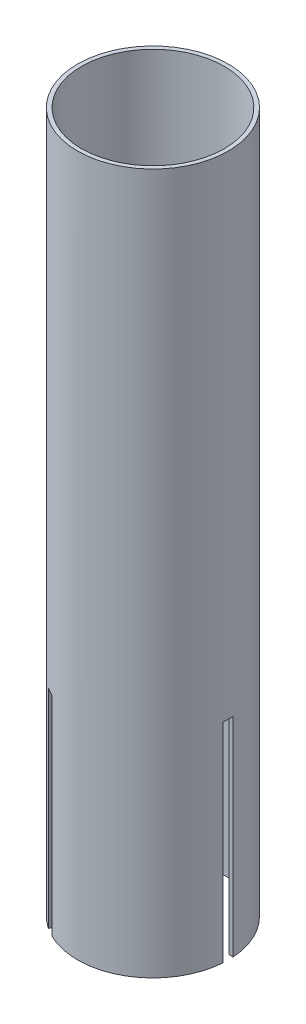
ISO-10303-21;
HEADER;
FILE_DESCRIPTION(('STEP AP214'),'2;1');
FILE_NAME('part.step','',(''),(''),'','','');
FILE_SCHEMA(('AUTOMOTIVE_DESIGN { 1 0 10303 214 1 1 1 1 }'));
ENDSEC;
DATA;
#1=APPLICATION_CONTEXT('core data for automotive mechanical design processes');
#2=APPLICATION_PROTOCOL_DEFINITION('international standard','automotive_design',2000,#1);
#3=PRODUCT_CONTEXT('',#1,'mechanical');
#4=PRODUCT('Part','Part','',(#3));
#5=PRODUCT_RELATED_PRODUCT_CATEGORY('part','',(#4));
#6=PRODUCT_DEFINITION_FORMATION('','',#4);
#7=PRODUCT_DEFINITION_CONTEXT('part definition',#1,'design');
#8=PRODUCT_DEFINITION('design','',#6,#7);
#9=PRODUCT_DEFINITION_SHAPE('','',#8);
#10=(LENGTH_UNIT() NAMED_UNIT(*) SI_UNIT(.MILLI.,.METRE.));
#11=(NAMED_UNIT(*) PLANE_ANGLE_UNIT() SI_UNIT($,.RADIAN.));
#12=(NAMED_UNIT(*) SI_UNIT($,.STERADIAN.) SOLID_ANGLE_UNIT());
#13=UNCERTAINTY_MEASURE_WITH_UNIT(LENGTH_MEASURE(1.E-05),#10,'distance_accuracy_value','');
#14=(GEOMETRIC_REPRESENTATION_CONTEXT(3) GLOBAL_UNCERTAINTY_ASSIGNED_CONTEXT((#13)) GLOBAL_UNIT_ASSIGNED_CONTEXT((#10,
#11,#12)) REPRESENTATION_CONTEXT('',''));
#15=CARTESIAN_POINT('',(0.,0.,0.));
#16=DIRECTION('',(0.,0.,1.));
#17=DIRECTION('',(1.,0.,0.));
#18=AXIS2_PLACEMENT_3D('',#15,#16,#17);
#19=CARTESIAN_POINT('',(0.,0.,0.));
#20=DIRECTION('',(0.,1.,0.));
#21=DIRECTION('',(0.,0.,1.));
#22=AXIS2_PLACEMENT_3D('',#19,#20,#21);
#23=PLANE('',#22);
#24=CARTESIAN_POINT('',(0.,0.,0.));
#25=DIRECTION('',(0.,1.,0.));
#26=DIRECTION('',(1.,0.,0.));
#27=AXIS2_PLACEMENT_3D('',#24,#25,#26);
#28=CIRCLE('',#27,27.178);
#29=CARTESIAN_POINT('',(-15.2053552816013,0.,-22.5264478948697));
#30=VERTEX_POINT('',#29);
#31=CARTESIAN_POINT('',(-15.2053552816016,0.,22.5264478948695));
#32=VERTEX_POINT('',#31);
#33=EDGE_CURVE('E141',#30,#32,#28,.T.);
#34=ORIENTED_EDGE('',*,*,#33,.T.);
#35=DIRECTION('',(0.500000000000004,0.,-0.866025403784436));
#36=VECTOR('',#35,1.);
#37=CARTESIAN_POINT('',(-17.4195842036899,0.,26.3616048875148));
#38=LINE('',#37,#36);
#39=CARTESIAN_POINT('',(-15.9691339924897,0.,23.8493514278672));
#40=VERTEX_POINT('',#39);
#41=EDGE_CURVE('E188',#40,#32,#38,.T.);
#42=ORIENTED_EDGE('',*,*,#41,.F.);
#43=CARTESIAN_POINT('',(0.,0.,0.));
#44=DIRECTION('',(0.,1.,0.));
#45=DIRECTION('',(0.,0.,1.));
#46=AXIS2_PLACEMENT_3D('',#43,#44,#45);
#47=CIRCLE('',#46,28.702);
#48=CARTESIAN_POINT('',(-15.9691339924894,0.,-23.8493514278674));
#49=VERTEX_POINT('',#48);
#50=EDGE_CURVE('E143',#49,#40,#47,.T.);
#51=ORIENTED_EDGE('',*,*,#50,.F.);
#52=DIRECTION('',(-0.499999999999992,0.,-0.866025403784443));
#53=VECTOR('',#52,1.);
#54=CARTESIAN_POINT('',(-1.64977839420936,0.,0.952499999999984));
#55=LINE('',#54,#53);
#56=EDGE_CURVE('E129',#30,#49,#55,.T.);
#57=ORIENTED_EDGE('',*,*,#56,.F.);
#58=EDGE_LOOP('',(#34,#42,#51,#57));
#59=FACE_BOUND('',#58,.T.);
#60=ADVANCED_FACE('F40',(#59),#23,.F.);
#61=CARTESIAN_POINT('',(27.1111537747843,0.,-1.905));
#62=VERTEX_POINT('',#61);
#63=CARTESIAN_POINT('',(-11.9057984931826,0.,-24.4314478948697));
#64=VERTEX_POINT('',#63);
#65=EDGE_CURVE('E150',#62,#64,#28,.T.);
#66=ORIENTED_EDGE('',*,*,#65,.T.);
#67=DIRECTION('',(0.499999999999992,0.,0.866025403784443));
#68=VECTOR('',#67,1.);
#69=CARTESIAN_POINT('',(-14.1200274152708,0.,-28.266604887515));
#70=LINE('',#69,#68);
#71=CARTESIAN_POINT('',(-12.6695772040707,0.,-25.7543514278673));
#72=VERTEX_POINT('',#71);
#73=EDGE_CURVE('E144',#72,#64,#70,.T.);
#74=ORIENTED_EDGE('',*,*,#73,.F.);
#75=CARTESIAN_POINT('',(28.6387111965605,0.,-1.905));
#76=VERTEX_POINT('',#75);
#77=EDGE_CURVE('E163',#76,#72,#47,.T.);
#78=ORIENTED_EDGE('',*,*,#77,.F.);
#79=DIRECTION('',(1.,0.,0.));
#80=VECTOR('',#79,1.);
#81=CARTESIAN_POINT('',(0.,0.,-1.905));
#82=LINE('',#81,#80);
#83=EDGE_CURVE('E209',#62,#76,#82,.T.);
#84=ORIENTED_EDGE('',*,*,#83,.F.);
#85=EDGE_LOOP('',(#66,#74,#78,#84));
#86=FACE_BOUND('',#85,.T.);
#87=ADVANCED_FACE('F247',(#86),#23,.F.);
#88=CARTESIAN_POINT('',(0.,266.7,0.));
#89=DIRECTION('',(0.,1.,0.));
#90=DIRECTION('',(0.,0.,1.));
#91=AXIS2_PLACEMENT_3D('',#88,#89,#90);
#92=PLANE('',#91);
#93=CARTESIAN_POINT('',(0.,266.7,0.));
#94=DIRECTION('',(0.,1.,0.));
#95=DIRECTION('',(0.,0.,1.));
#96=AXIS2_PLACEMENT_3D('',#93,#94,#95);
#97=CIRCLE('',#96,28.702);
#98=CARTESIAN_POINT('',(0.,266.7,28.702));
#99=VERTEX_POINT('',#98);
#100=EDGE_CURVE('E159',#99,#99,#97,.T.);
#101=ORIENTED_EDGE('',*,*,#100,.T.);
#102=EDGE_LOOP('',(#101));
#103=FACE_BOUND('',#102,.T.);
#104=CARTESIAN_POINT('',(0.,266.7,0.));
#105=DIRECTION('',(0.,1.,0.));
#106=DIRECTION('',(1.,0.,0.));
#107=AXIS2_PLACEMENT_3D('',#104,#105,#106);
#108=CIRCLE('',#107,27.178);
#109=CARTESIAN_POINT('',(27.178,266.7,0.));
#110=VERTEX_POINT('',#109);
#111=EDGE_CURVE('E154',#110,#110,#108,.T.);
#112=ORIENTED_EDGE('',*,*,#111,.F.);
#113=EDGE_LOOP('',(#112));
#114=FACE_BOUND('',#113,.T.);
#115=ADVANCED_FACE('F270',(#103,#114),#92,.T.);
#116=CARTESIAN_POINT('',(-12.669577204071,0.,25.7543514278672));
#117=VERTEX_POINT('',#116);
#118=CARTESIAN_POINT('',(28.6387111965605,0.,1.905));
#119=VERTEX_POINT('',#118);
#120=EDGE_CURVE('E166',#117,#119,#47,.T.);
#121=ORIENTED_EDGE('',*,*,#120,.F.);
#122=DIRECTION('',(-0.500000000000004,0.,0.866025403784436));
#123=VECTOR('',#122,1.);
#124=CARTESIAN_POINT('',(1.64977839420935,0.,0.952500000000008));
#125=LINE('',#124,#123);
#126=CARTESIAN_POINT('',(-11.9057984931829,0.,24.4314478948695));
#127=VERTEX_POINT('',#126);
#128=EDGE_CURVE('E192',#127,#117,#125,.T.);
#129=ORIENTED_EDGE('',*,*,#128,.F.);
#130=CARTESIAN_POINT('',(27.1111537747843,0.,1.905));
#131=VERTEX_POINT('',#130);
#132=EDGE_CURVE('E151',#127,#131,#28,.T.);
#133=ORIENTED_EDGE('',*,*,#132,.T.);
#134=DIRECTION('',(-1.,0.,0.));
#135=VECTOR('',#134,1.);
#136=CARTESIAN_POINT('',(31.5396116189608,0.,1.905));
#137=LINE('',#136,#135);
#138=EDGE_CURVE('E214',#119,#131,#137,.T.);
#139=ORIENTED_EDGE('',*,*,#138,.F.);
#140=EDGE_LOOP('',(#121,#129,#133,#139));
#141=FACE_BOUND('',#140,.T.);
#142=ADVANCED_FACE('F235',(#141),#23,.F.);
#143=CARTESIAN_POINT('',(0.,266.7,0.));
#144=DIRECTION('',(0.,-1.,0.));
#145=DIRECTION('',(0.,0.,-1.));
#146=AXIS2_PLACEMENT_3D('',#143,#144,#145);
#147=CYLINDRICAL_SURFACE('',#146,28.702);
#148=ORIENTED_EDGE('',*,*,#50,.T.);
#149=DIRECTION('',(0.,-1.,0.));
#150=VECTOR('',#149,1.);
#151=CARTESIAN_POINT('',(-15.9691339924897,266.7,23.8493514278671));
#152=LINE('',#151,#150);
#153=CARTESIAN_POINT('',(-15.9691339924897,79.375,23.8493514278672));
#154=VERTEX_POINT('',#153);
#155=EDGE_CURVE('E206',#40,#154,#152,.F.);
#156=ORIENTED_EDGE('',*,*,#155,.T.);
#157=CARTESIAN_POINT('',(0.,79.375,0.));
#158=DIRECTION('',(0.,-1.,0.));
#159=DIRECTION('',(0.,0.,-1.));
#160=AXIS2_PLACEMENT_3D('',#157,#158,#159);
#161=CIRCLE('',#160,28.702);
#162=CARTESIAN_POINT('',(-12.669577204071,79.375,25.7543514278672));
#163=VERTEX_POINT('',#162);
#164=EDGE_CURVE('E204',#163,#154,#161,.T.);
#165=ORIENTED_EDGE('',*,*,#164,.F.);
#166=DIRECTION('',(0.,-1.,0.));
#167=VECTOR('',#166,1.);
#168=CARTESIAN_POINT('',(-12.669577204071,266.7,25.7543514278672));
#169=LINE('',#168,#167);
#170=EDGE_CURVE('E187',#163,#117,#169,.T.);
#171=ORIENTED_EDGE('',*,*,#170,.T.);
#172=ORIENTED_EDGE('',*,*,#120,.T.);
#173=DIRECTION('',(0.,-1.,0.));
#174=VECTOR('',#173,1.);
#175=CARTESIAN_POINT('',(28.6387111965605,266.7,1.905));
#176=LINE('',#175,#174);
#177=CARTESIAN_POINT('',(28.6387111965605,79.375,1.905));
#178=VERTEX_POINT('',#177);
#179=EDGE_CURVE('E155',#119,#178,#176,.F.);
#180=ORIENTED_EDGE('',*,*,#179,.T.);
#181=CARTESIAN_POINT('',(0.,79.375,0.));
#182=DIRECTION('',(0.,-1.,0.));
#183=DIRECTION('',(0.,0.,-1.));
#184=AXIS2_PLACEMENT_3D('',#181,#182,#183);
#185=CIRCLE('',#184,28.702);
#186=CARTESIAN_POINT('',(28.6387111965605,79.375,-1.905));
#187=VERTEX_POINT('',#186);
#188=EDGE_CURVE('E216',#187,#178,#185,.T.);
#189=ORIENTED_EDGE('',*,*,#188,.F.);
#190=DIRECTION('',(0.,-1.,0.));
#191=VECTOR('',#190,1.);
#192=CARTESIAN_POINT('',(28.6387111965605,266.7,-1.905));
#193=LINE('',#192,#191);
#194=EDGE_CURVE('E221',#187,#76,#193,.T.);
#195=ORIENTED_EDGE('',*,*,#194,.T.);
#196=ORIENTED_EDGE('',*,*,#77,.T.);
#197=DIRECTION('',(0.,-1.,0.));
#198=VECTOR('',#197,1.);
#199=CARTESIAN_POINT('',(-12.6695772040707,266.7,-25.7543514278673));
#200=LINE('',#199,#198);
#201=CARTESIAN_POINT('',(-12.6695772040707,79.375,-25.7543514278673));
#202=VERTEX_POINT('',#201);
#203=EDGE_CURVE('E199',#72,#202,#200,.F.);
#204=ORIENTED_EDGE('',*,*,#203,.T.);
#205=CARTESIAN_POINT('',(-15.9691339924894,79.375,-23.8493514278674));
#206=VERTEX_POINT('',#205);
#207=EDGE_CURVE('E202',#206,#202,#161,.T.);
#208=ORIENTED_EDGE('',*,*,#207,.F.);
#209=DIRECTION('',(0.,-1.,0.));
#210=VECTOR('',#209,1.);
#211=CARTESIAN_POINT('',(-15.9691339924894,266.7,-23.8493514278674));
#212=LINE('',#211,#210);
#213=EDGE_CURVE('E190',#206,#49,#212,.T.);
#214=ORIENTED_EDGE('',*,*,#213,.T.);
#215=EDGE_LOOP('',(#148,#156,#165,#171,#172,#180,#189,#195,#196,#204,#208,#214));
#216=FACE_BOUND('',#215,.T.);
#217=ORIENTED_EDGE('',*,*,#100,.F.);
#218=EDGE_LOOP('',(#217));
#219=FACE_BOUND('',#218,.T.);
#220=ADVANCED_FACE('F42',(#216,#219),#147,.T.);
#221=CARTESIAN_POINT('',(0.,266.7,0.));
#222=DIRECTION('',(0.,-1.,0.));
#223=DIRECTION('',(0.,0.,-1.));
#224=AXIS2_PLACEMENT_3D('',#221,#222,#223);
#225=CYLINDRICAL_SURFACE('',#224,27.178);
#226=DIRECTION('',(0.,-1.,0.));
#227=VECTOR('',#226,1.);
#228=CARTESIAN_POINT('',(-15.2053552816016,266.7,22.5264478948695));
#229=LINE('',#228,#227);
#230=CARTESIAN_POINT('',(-15.2053552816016,79.375,22.5264478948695));
#231=VERTEX_POINT('',#230);
#232=EDGE_CURVE('E12',#32,#231,#229,.F.);
#233=ORIENTED_EDGE('',*,*,#232,.F.);
#234=ORIENTED_EDGE('',*,*,#33,.F.);
#235=DIRECTION('',(0.,-1.,0.));
#236=VECTOR('',#235,1.);
#237=CARTESIAN_POINT('',(-15.2053552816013,266.7,-22.5264478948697));
#238=LINE('',#237,#236);
#239=CARTESIAN_POINT('',(-15.2053552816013,79.375,-22.5264478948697));
#240=VERTEX_POINT('',#239);
#241=EDGE_CURVE('E126',#240,#30,#238,.T.);
#242=ORIENTED_EDGE('',*,*,#241,.F.);
#243=CARTESIAN_POINT('',(0.,79.375,0.));
#244=DIRECTION('',(0.,-1.,0.));
#245=DIRECTION('',(0.,0.,-1.));
#246=AXIS2_PLACEMENT_3D('',#243,#244,#245);
#247=CIRCLE('',#246,27.178);
#248=CARTESIAN_POINT('',(-11.9057984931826,79.375,-24.4314478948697));
#249=VERTEX_POINT('',#248);
#250=EDGE_CURVE('E134',#240,#249,#247,.T.);
#251=ORIENTED_EDGE('',*,*,#250,.T.);
#252=DIRECTION('',(0.,-1.,0.));
#253=VECTOR('',#252,1.);
#254=CARTESIAN_POINT('',(-11.9057984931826,266.7,-24.4314478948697));
#255=LINE('',#254,#253);
#256=EDGE_CURVE('E174',#64,#249,#255,.F.);
#257=ORIENTED_EDGE('',*,*,#256,.F.);
#258=ORIENTED_EDGE('',*,*,#65,.F.);
#259=DIRECTION('',(0.,-1.,0.));
#260=VECTOR('',#259,1.);
#261=CARTESIAN_POINT('',(27.1111537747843,266.7,-1.905));
#262=LINE('',#261,#260);
#263=CARTESIAN_POINT('',(27.1111537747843,79.375,-1.905));
#264=VERTEX_POINT('',#263);
#265=EDGE_CURVE('E169',#264,#62,#262,.T.);
#266=ORIENTED_EDGE('',*,*,#265,.F.);
#267=CARTESIAN_POINT('',(0.,79.375,0.));
#268=DIRECTION('',(0.,-1.,0.));
#269=DIRECTION('',(0.,0.,-1.));
#270=AXIS2_PLACEMENT_3D('',#267,#268,#269);
#271=CIRCLE('',#270,27.178);
#272=CARTESIAN_POINT('',(27.1111537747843,79.375,1.905));
#273=VERTEX_POINT('',#272);
#274=EDGE_CURVE('E162',#264,#273,#271,.T.);
#275=ORIENTED_EDGE('',*,*,#274,.T.);
#276=DIRECTION('',(0.,-1.,0.));
#277=VECTOR('',#276,1.);
#278=CARTESIAN_POINT('',(27.1111537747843,266.7,1.905));
#279=LINE('',#278,#277);
#280=EDGE_CURVE('E135',#131,#273,#279,.F.);
#281=ORIENTED_EDGE('',*,*,#280,.F.);
#282=ORIENTED_EDGE('',*,*,#132,.F.);
#283=DIRECTION('',(0.,-1.,0.));
#284=VECTOR('',#283,1.);
#285=CARTESIAN_POINT('',(-11.9057984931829,266.7,24.4314478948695));
#286=LINE('',#285,#284);
#287=CARTESIAN_POINT('',(-11.9057984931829,79.375,24.4314478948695));
#288=VERTEX_POINT('',#287);
#289=EDGE_CURVE('E48',#288,#127,#286,.T.);
#290=ORIENTED_EDGE('',*,*,#289,.F.);
#291=EDGE_CURVE('E175',#288,#231,#247,.T.);
#292=ORIENTED_EDGE('',*,*,#291,.T.);
#293=EDGE_LOOP('',(#233,#234,#242,#251,#257,#258,#266,#275,#281,#282,#290,#292));
#294=FACE_BOUND('',#293,.T.);
#295=ORIENTED_EDGE('',*,*,#111,.T.);
#296=EDGE_LOOP('',(#295));
#297=FACE_BOUND('',#296,.T.);
#298=ADVANCED_FACE('F147',(#294,#297),#225,.F.);
#299=CARTESIAN_POINT('',(31.5396116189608,79.375,1.905));
#300=DIRECTION('',(0.,0.,1.));
#301=DIRECTION('',(1.,0.,0.));
#302=AXIS2_PLACEMENT_3D('',#299,#300,#301);
#303=PLANE('',#302);
#304=ORIENTED_EDGE('',*,*,#138,.T.);
#305=ORIENTED_EDGE('',*,*,#280,.T.);
#306=DIRECTION('',(-1.,0.,0.));
#307=VECTOR('',#306,1.);
#308=CARTESIAN_POINT('',(31.5396116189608,79.375,1.905));
#309=LINE('',#308,#307);
#310=EDGE_CURVE('E213',#178,#273,#309,.T.);
#311=ORIENTED_EDGE('',*,*,#310,.F.);
#312=ORIENTED_EDGE('',*,*,#179,.F.);
#313=EDGE_LOOP('',(#304,#305,#311,#312));
#314=FACE_BOUND('',#313,.T.);
#315=ADVANCED_FACE('F232',(#314),#303,.F.);
#316=CARTESIAN_POINT('',(0.,79.375,-1.905));
#317=DIRECTION('',(0.,0.,-1.));
#318=DIRECTION('',(-1.,0.,0.));
#319=AXIS2_PLACEMENT_3D('',#316,#317,#318);
#320=PLANE('',#319);
#321=DIRECTION('',(1.,0.,0.));
#322=VECTOR('',#321,1.);
#323=CARTESIAN_POINT('',(0.,79.375,-1.905));
#324=LINE('',#323,#322);
#325=EDGE_CURVE('E210',#264,#187,#324,.T.);
#326=ORIENTED_EDGE('',*,*,#325,.F.);
#327=ORIENTED_EDGE('',*,*,#265,.T.);
#328=ORIENTED_EDGE('',*,*,#83,.T.);
#329=ORIENTED_EDGE('',*,*,#194,.F.);
#330=EDGE_LOOP('',(#326,#327,#328,#329));
#331=FACE_BOUND('',#330,.T.);
#332=ADVANCED_FACE('F242',(#331),#320,.F.);
#333=CARTESIAN_POINT('',(0.,79.375,0.));
#334=DIRECTION('',(0.,-1.,0.));
#335=DIRECTION('',(0.,0.,-1.));
#336=AXIS2_PLACEMENT_3D('',#333,#334,#335);
#337=PLANE('',#336);
#338=ORIENTED_EDGE('',*,*,#188,.T.);
#339=ORIENTED_EDGE('',*,*,#310,.T.);
#340=ORIENTED_EDGE('',*,*,#274,.F.);
#341=ORIENTED_EDGE('',*,*,#325,.T.);
#342=EDGE_LOOP('',(#338,#339,#340,#341));
#343=FACE_BOUND('',#342,.T.);
#344=ADVANCED_FACE('F240',(#343),#337,.T.);
#345=CARTESIAN_POINT('',(-14.1200274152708,79.375,-28.266604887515));
#346=DIRECTION('',(0.866025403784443,0.,-0.499999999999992));
#347=DIRECTION('',(-0.499999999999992,0.,-0.866025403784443));
#348=AXIS2_PLACEMENT_3D('',#345,#346,#347);
#349=PLANE('',#348);
#350=ORIENTED_EDGE('',*,*,#73,.T.);
#351=ORIENTED_EDGE('',*,*,#256,.T.);
#352=DIRECTION('',(0.499999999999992,0.,0.866025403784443));
#353=VECTOR('',#352,1.);
#354=CARTESIAN_POINT('',(-14.1200274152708,79.375,-28.266604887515));
#355=LINE('',#354,#353);
#356=EDGE_CURVE('E196',#202,#249,#355,.T.);
#357=ORIENTED_EDGE('',*,*,#356,.F.);
#358=ORIENTED_EDGE('',*,*,#203,.F.);
#359=EDGE_LOOP('',(#350,#351,#357,#358));
#360=FACE_BOUND('',#359,.T.);
#361=ADVANCED_FACE('F257',(#360),#349,.F.);
#362=CARTESIAN_POINT('',(-1.64977839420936,79.375,0.952499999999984));
#363=DIRECTION('',(-0.866025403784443,0.,0.499999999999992));
#364=DIRECTION('',(0.499999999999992,0.,0.866025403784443));
#365=AXIS2_PLACEMENT_3D('',#362,#363,#364);
#366=PLANE('',#365);
#367=DIRECTION('',(-0.499999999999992,0.,-0.866025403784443));
#368=VECTOR('',#367,1.);
#369=CARTESIAN_POINT('',(-1.64977839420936,79.375,0.952499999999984));
#370=LINE('',#369,#368);
#371=EDGE_CURVE('E62',#240,#206,#370,.T.);
#372=ORIENTED_EDGE('',*,*,#371,.F.);
#373=ORIENTED_EDGE('',*,*,#241,.T.);
#374=ORIENTED_EDGE('',*,*,#56,.T.);
#375=ORIENTED_EDGE('',*,*,#213,.F.);
#376=EDGE_LOOP('',(#372,#373,#374,#375));
#377=FACE_BOUND('',#376,.T.);
#378=ADVANCED_FACE('F128',(#377),#366,.F.);
#379=CARTESIAN_POINT('',(0.,79.375,0.));
#380=DIRECTION('',(0.,-1.,0.));
#381=DIRECTION('',(0.866025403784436,0.,0.500000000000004));
#382=AXIS2_PLACEMENT_3D('',#379,#380,#381);
#383=PLANE('',#382);
#384=ORIENTED_EDGE('',*,*,#207,.T.);
#385=ORIENTED_EDGE('',*,*,#356,.T.);
#386=ORIENTED_EDGE('',*,*,#250,.F.);
#387=ORIENTED_EDGE('',*,*,#371,.T.);
#388=EDGE_LOOP('',(#384,#385,#386,#387));
#389=FACE_BOUND('',#388,.T.);
#390=ADVANCED_FACE('F256',(#389),#383,.T.);
#391=CARTESIAN_POINT('',(-17.4195842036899,79.375,26.3616048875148));
#392=DIRECTION('',(-0.866025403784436,0.,-0.500000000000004));
#393=DIRECTION('',(-0.500000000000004,0.,0.866025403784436));
#394=AXIS2_PLACEMENT_3D('',#391,#392,#393);
#395=PLANE('',#394);
#396=ORIENTED_EDGE('',*,*,#41,.T.);
#397=ORIENTED_EDGE('',*,*,#232,.T.);
#398=DIRECTION('',(0.500000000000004,0.,-0.866025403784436));
#399=VECTOR('',#398,1.);
#400=CARTESIAN_POINT('',(-17.4195842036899,79.375,26.3616048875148));
#401=LINE('',#400,#399);
#402=EDGE_CURVE('E55',#154,#231,#401,.T.);
#403=ORIENTED_EDGE('',*,*,#402,.F.);
#404=ORIENTED_EDGE('',*,*,#155,.F.);
#405=EDGE_LOOP('',(#396,#397,#403,#404));
#406=FACE_BOUND('',#405,.T.);
#407=ADVANCED_FACE('F290',(#406),#395,.F.);
#408=CARTESIAN_POINT('',(1.64977839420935,79.375,0.952500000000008));
#409=DIRECTION('',(0.866025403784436,0.,0.500000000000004));
#410=DIRECTION('',(0.500000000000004,0.,-0.866025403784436));
#411=AXIS2_PLACEMENT_3D('',#408,#409,#410);
#412=PLANE('',#411);
#413=DIRECTION('',(-0.500000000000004,0.,0.866025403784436));
#414=VECTOR('',#413,1.);
#415=CARTESIAN_POINT('',(1.64977839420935,79.375,0.952500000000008));
#416=LINE('',#415,#414);
#417=EDGE_CURVE('E183',#288,#163,#416,.T.);
#418=ORIENTED_EDGE('',*,*,#417,.F.);
#419=ORIENTED_EDGE('',*,*,#289,.T.);
#420=ORIENTED_EDGE('',*,*,#128,.T.);
#421=ORIENTED_EDGE('',*,*,#170,.F.);
#422=EDGE_LOOP('',(#418,#419,#420,#421));
#423=FACE_BOUND('',#422,.T.);
#424=ADVANCED_FACE('F185',(#423),#412,.F.);
#425=ORIENTED_EDGE('',*,*,#164,.T.);
#426=ORIENTED_EDGE('',*,*,#402,.T.);
#427=ORIENTED_EDGE('',*,*,#291,.F.);
#428=ORIENTED_EDGE('',*,*,#417,.T.);
#429=EDGE_LOOP('',(#425,#426,#427,#428));
#430=FACE_BOUND('',#429,.T.);
#431=ADVANCED_FACE('F182',(#430),#383,.T.);
#432=CLOSED_SHELL('',(#60,#87,#115,#142,#220,#298,#315,#332,#344,#361,#378,#390,#407,#424,#431));
#433=MANIFOLD_SOLID_BREP('B2',#432);
#434=ADVANCED_BREP_SHAPE_REPRESENTATION('',(#18,#433),#14);
#435=SHAPE_DEFINITION_REPRESENTATION(#9,#434);
ENDSEC;
END-ISO-10303-21;
